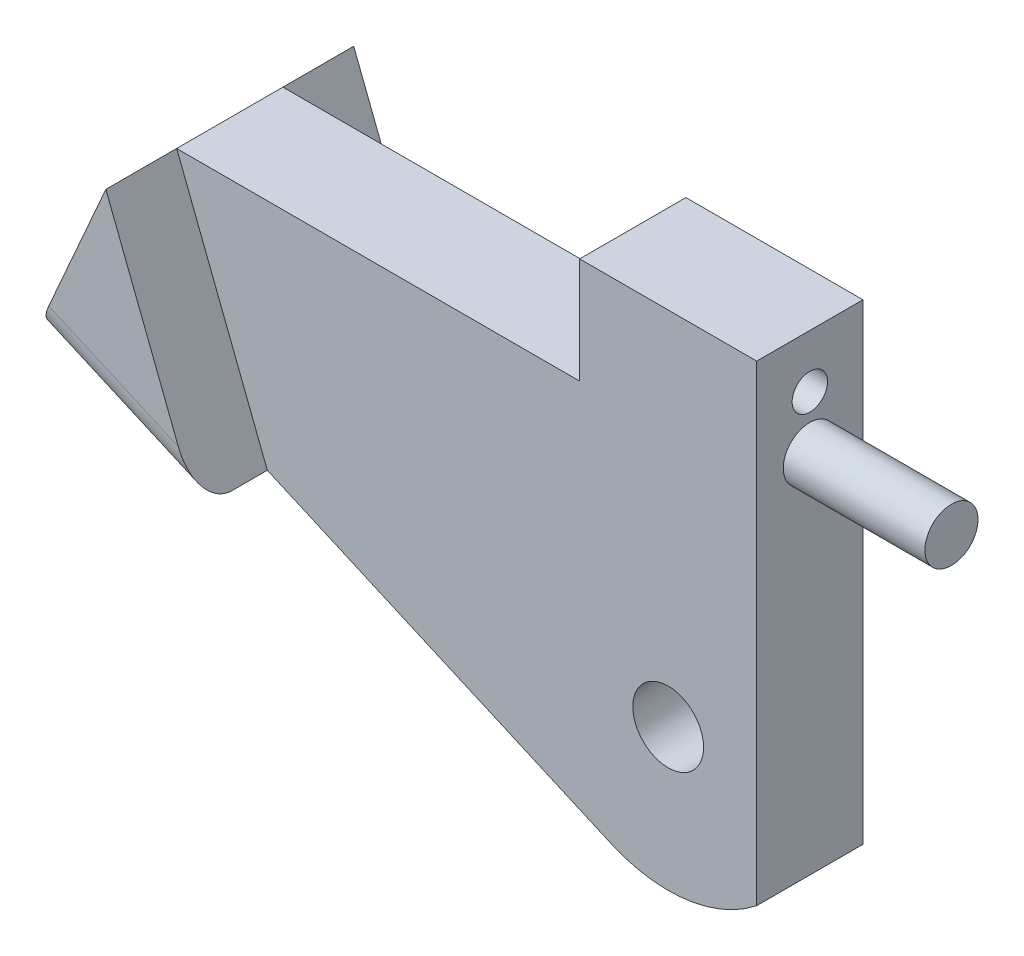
ISO-10303-21;
HEADER;
FILE_DESCRIPTION(('STEP AP214'),'2;1');
FILE_NAME('part.step','',(''),(''),'','','');
FILE_SCHEMA(('AUTOMOTIVE_DESIGN { 1 0 10303 214 1 1 1 1 }'));
ENDSEC;
DATA;
#1=APPLICATION_CONTEXT('core data for automotive mechanical design processes');
#2=APPLICATION_PROTOCOL_DEFINITION('international standard','automotive_design',2000,#1);
#3=PRODUCT_CONTEXT('',#1,'mechanical');
#4=PRODUCT('Part','Part','',(#3));
#5=PRODUCT_RELATED_PRODUCT_CATEGORY('part','',(#4));
#6=PRODUCT_DEFINITION_FORMATION('','',#4);
#7=PRODUCT_DEFINITION_CONTEXT('part definition',#1,'design');
#8=PRODUCT_DEFINITION('design','',#6,#7);
#9=PRODUCT_DEFINITION_SHAPE('','',#8);
#10=(LENGTH_UNIT() NAMED_UNIT(*) SI_UNIT(.MILLI.,.METRE.));
#11=(NAMED_UNIT(*) PLANE_ANGLE_UNIT() SI_UNIT($,.RADIAN.));
#12=(NAMED_UNIT(*) SI_UNIT($,.STERADIAN.) SOLID_ANGLE_UNIT());
#13=UNCERTAINTY_MEASURE_WITH_UNIT(LENGTH_MEASURE(1.E-05),#10,'distance_accuracy_value','');
#14=(GEOMETRIC_REPRESENTATION_CONTEXT(3) GLOBAL_UNCERTAINTY_ASSIGNED_CONTEXT((#13)) GLOBAL_UNIT_ASSIGNED_CONTEXT((#10,
#11,#12)) REPRESENTATION_CONTEXT('',''));
#15=CARTESIAN_POINT('',(0.,0.,0.));
#16=DIRECTION('',(0.,0.,1.));
#17=DIRECTION('',(1.,0.,0.));
#18=AXIS2_PLACEMENT_3D('',#15,#16,#17);
#19=CARTESIAN_POINT('',(2.5,-3.1224989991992,1.5));
#20=DIRECTION('',(-1.,0.,0.));
#21=DIRECTION('',(0.,-1.,0.));
#22=AXIS2_PLACEMENT_3D('',#19,#20,#21);
#23=PLANE('',#22);
#24=DIRECTION('',(0.,1.,0.));
#25=VECTOR('',#24,1.);
#26=CARTESIAN_POINT('',(2.5,-3.1224989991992,-1.5));
#27=LINE('',#26,#25);
#28=CARTESIAN_POINT('',(2.5,-3.1224989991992,-1.5));
#29=VERTEX_POINT('',#28);
#30=CARTESIAN_POINT('',(2.5,10.1980390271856,-1.5));
#31=VERTEX_POINT('',#30);
#32=EDGE_CURVE('E165',#29,#31,#27,.T.);
#33=ORIENTED_EDGE('',*,*,#32,.T.);
#34=DIRECTION('',(0.,0.,-1.));
#35=VECTOR('',#34,1.);
#36=CARTESIAN_POINT('',(2.5,10.1980390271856,1.5));
#37=LINE('',#36,#35);
#38=CARTESIAN_POINT('',(2.5,10.1980390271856,1.5));
#39=VERTEX_POINT('',#38);
#40=EDGE_CURVE('E185',#39,#31,#37,.T.);
#41=ORIENTED_EDGE('',*,*,#40,.F.);
#42=DIRECTION('',(0.,1.,0.));
#43=VECTOR('',#42,1.);
#44=CARTESIAN_POINT('',(2.5,-3.1224989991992,1.5));
#45=LINE('',#44,#43);
#46=CARTESIAN_POINT('',(2.5,-3.1224989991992,1.5));
#47=VERTEX_POINT('',#46);
#48=EDGE_CURVE('E178',#47,#39,#45,.T.);
#49=ORIENTED_EDGE('',*,*,#48,.F.);
#50=DIRECTION('',(0.,0.,-1.));
#51=VECTOR('',#50,1.);
#52=CARTESIAN_POINT('',(2.5,-3.1224989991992,1.5));
#53=LINE('',#52,#51);
#54=EDGE_CURVE('E188',#47,#29,#53,.T.);
#55=ORIENTED_EDGE('',*,*,#54,.T.);
#56=EDGE_LOOP('',(#33,#41,#49,#55));
#57=FACE_BOUND('',#56,.T.);
#58=CARTESIAN_POINT('',(2.5,8.69803902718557,0.));
#59=DIRECTION('',(1.,0.,0.));
#60=DIRECTION('',(0.,1.,0.));
#61=AXIS2_PLACEMENT_3D('',#58,#59,#60);
#62=CIRCLE('',#61,0.500000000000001);
#63=CARTESIAN_POINT('',(2.5,9.19803902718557,0.));
#64=VERTEX_POINT('',#63);
#65=EDGE_CURVE('E431',#64,#64,#62,.T.);
#66=ORIENTED_EDGE('',*,*,#65,.F.);
#67=EDGE_LOOP('',(#66));
#68=FACE_BOUND('',#67,.T.);
#69=CARTESIAN_POINT('',(2.5,7.19803902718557,0.));
#70=DIRECTION('',(-1.,0.,0.));
#71=DIRECTION('',(0.,-1.,0.));
#72=AXIS2_PLACEMENT_3D('',#69,#70,#71);
#73=CIRCLE('',#72,0.75);
#74=CARTESIAN_POINT('',(2.5,6.44803902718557,0.));
#75=VERTEX_POINT('',#74);
#76=EDGE_CURVE('E203',#75,#75,#73,.F.);
#77=ORIENTED_EDGE('',*,*,#76,.F.);
#78=EDGE_LOOP('',(#77));
#79=FACE_BOUND('',#78,.T.);
#80=ADVANCED_FACE('F28',(#57,#68,#79),#23,.F.);
#81=CARTESIAN_POINT('',(0.,0.,1.5));
#82=DIRECTION('',(0.,0.,1.));
#83=DIRECTION('',(1.,0.,0.));
#84=AXIS2_PLACEMENT_3D('',#81,#82,#83);
#85=PLANE('',#84);
#86=CARTESIAN_POINT('',(0.,0.,1.5));
#87=DIRECTION('',(0.,0.,1.));
#88=DIRECTION('',(1.,0.,0.));
#89=AXIS2_PLACEMENT_3D('',#86,#87,#88);
#90=CIRCLE('',#89,1.);
#91=CARTESIAN_POINT('',(1.,0.,1.5));
#92=VERTEX_POINT('',#91);
#93=EDGE_CURVE('E129',#92,#92,#90,.T.);
#94=ORIENTED_EDGE('',*,*,#93,.F.);
#95=EDGE_LOOP('',(#94));
#96=FACE_BOUND('',#95,.T.);
#97=DIRECTION('',(-1.,0.,0.));
#98=VECTOR('',#97,1.);
#99=CARTESIAN_POINT('',(-2.5,7.20803853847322,1.5));
#100=LINE('',#99,#98);
#101=CARTESIAN_POINT('',(-2.5,7.20803853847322,1.5));
#102=VERTEX_POINT('',#101);
#103=CARTESIAN_POINT('',(-13.8822289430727,7.20803853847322,1.5));
#104=VERTEX_POINT('',#103);
#105=EDGE_CURVE('E172',#102,#104,#100,.T.);
#106=ORIENTED_EDGE('',*,*,#105,.T.);
#107=DIRECTION('',(0.362045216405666,-0.932160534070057,0.));
#108=VECTOR('',#107,1.);
#109=CARTESIAN_POINT('',(-9.62999207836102,-3.74022760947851,1.5));
#110=LINE('',#109,#108);
#111=CARTESIAN_POINT('',(-11.3221826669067,0.616668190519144,1.5));
#112=VERTEX_POINT('',#111);
#113=EDGE_CURVE('E152',#104,#112,#110,.T.);
#114=ORIENTED_EDGE('',*,*,#113,.T.);
#115=DIRECTION('',(0.915141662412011,-0.403132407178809,0.));
#116=VECTOR('',#115,1.);
#117=CARTESIAN_POINT('',(-15.8978909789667,2.63233022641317,1.5));
#118=LINE('',#117,#116);
#119=CARTESIAN_POINT('',(-1.61252962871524,-3.66056664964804,1.5));
#120=VERTEX_POINT('',#119);
#121=EDGE_CURVE('E174',#112,#120,#118,.T.);
#122=ORIENTED_EDGE('',*,*,#121,.T.);
#123=CARTESIAN_POINT('',(0.,0.,1.5));
#124=DIRECTION('',(0.,0.,1.));
#125=DIRECTION('',(1.,0.,0.));
#126=AXIS2_PLACEMENT_3D('',#123,#124,#125);
#127=CIRCLE('',#126,4.);
#128=EDGE_CURVE('E176',#120,#47,#127,.T.);
#129=ORIENTED_EDGE('',*,*,#128,.T.);
#130=ORIENTED_EDGE('',*,*,#48,.T.);
#131=DIRECTION('',(-1.,0.,0.));
#132=VECTOR('',#131,1.);
#133=CARTESIAN_POINT('',(-2.5,10.1980390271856,1.5));
#134=LINE('',#133,#132);
#135=CARTESIAN_POINT('',(-2.5,10.1980390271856,1.5));
#136=VERTEX_POINT('',#135);
#137=EDGE_CURVE('E180',#39,#136,#134,.T.);
#138=ORIENTED_EDGE('',*,*,#137,.T.);
#139=DIRECTION('',(0.,-1.,0.));
#140=VECTOR('',#139,1.);
#141=CARTESIAN_POINT('',(-2.5,10.1980390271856,1.5));
#142=LINE('',#141,#140);
#143=EDGE_CURVE('E169',#136,#102,#142,.T.);
#144=ORIENTED_EDGE('',*,*,#143,.T.);
#145=EDGE_LOOP('',(#106,#114,#122,#129,#130,#138,#144));
#146=FACE_BOUND('',#145,.T.);
#147=ADVANCED_FACE('F229',(#96,#146),#85,.T.);
#148=CARTESIAN_POINT('',(0.,0.,-1.5));
#149=DIRECTION('',(0.,0.,1.));
#150=DIRECTION('',(1.,0.,0.));
#151=AXIS2_PLACEMENT_3D('',#148,#149,#150);
#152=PLANE('',#151);
#153=CARTESIAN_POINT('',(0.,0.,-1.5));
#154=DIRECTION('',(0.,0.,1.));
#155=DIRECTION('',(1.,0.,0.));
#156=AXIS2_PLACEMENT_3D('',#153,#154,#155);
#157=CIRCLE('',#156,1.);
#158=CARTESIAN_POINT('',(1.,0.,-1.5));
#159=VERTEX_POINT('',#158);
#160=EDGE_CURVE('E204',#159,#159,#157,.T.);
#161=ORIENTED_EDGE('',*,*,#160,.T.);
#162=EDGE_LOOP('',(#161));
#163=FACE_BOUND('',#162,.T.);
#164=DIRECTION('',(0.362045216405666,-0.932160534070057,0.));
#165=VECTOR('',#164,1.);
#166=CARTESIAN_POINT('',(-9.62999207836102,-3.74022760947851,-1.5));
#167=LINE('',#166,#165);
#168=CARTESIAN_POINT('',(-13.8822289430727,7.20803853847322,-1.5));
#169=VERTEX_POINT('',#168);
#170=CARTESIAN_POINT('',(-11.3221826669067,0.616668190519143,-1.5));
#171=VERTEX_POINT('',#170);
#172=EDGE_CURVE('E201',#169,#171,#167,.T.);
#173=ORIENTED_EDGE('',*,*,#172,.F.);
#174=DIRECTION('',(-1.,0.,0.));
#175=VECTOR('',#174,1.);
#176=CARTESIAN_POINT('',(-2.5,7.20803853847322,-1.5));
#177=LINE('',#176,#175);
#178=CARTESIAN_POINT('',(-2.5,7.20803853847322,-1.5));
#179=VERTEX_POINT('',#178);
#180=EDGE_CURVE('E158',#179,#169,#177,.T.);
#181=ORIENTED_EDGE('',*,*,#180,.F.);
#182=DIRECTION('',(0.,-1.,0.));
#183=VECTOR('',#182,1.);
#184=CARTESIAN_POINT('',(-2.5,10.1980390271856,-1.5));
#185=LINE('',#184,#183);
#186=CARTESIAN_POINT('',(-2.5,10.1980390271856,-1.5));
#187=VERTEX_POINT('',#186);
#188=EDGE_CURVE('E155',#187,#179,#185,.T.);
#189=ORIENTED_EDGE('',*,*,#188,.F.);
#190=DIRECTION('',(-1.,0.,0.));
#191=VECTOR('',#190,1.);
#192=CARTESIAN_POINT('',(-2.5,10.1980390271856,-1.5));
#193=LINE('',#192,#191);
#194=EDGE_CURVE('E167',#31,#187,#193,.T.);
#195=ORIENTED_EDGE('',*,*,#194,.F.);
#196=ORIENTED_EDGE('',*,*,#32,.F.);
#197=CARTESIAN_POINT('',(0.,0.,-1.5));
#198=DIRECTION('',(0.,0.,1.));
#199=DIRECTION('',(1.,0.,0.));
#200=AXIS2_PLACEMENT_3D('',#197,#198,#199);
#201=CIRCLE('',#200,4.);
#202=CARTESIAN_POINT('',(-1.61252962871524,-3.66056664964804,-1.5));
#203=VERTEX_POINT('',#202);
#204=EDGE_CURVE('E163',#203,#29,#201,.T.);
#205=ORIENTED_EDGE('',*,*,#204,.F.);
#206=DIRECTION('',(0.915141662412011,-0.403132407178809,0.));
#207=VECTOR('',#206,1.);
#208=CARTESIAN_POINT('',(-15.8978909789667,2.63233022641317,-1.5));
#209=LINE('',#208,#207);
#210=EDGE_CURVE('E161',#171,#203,#209,.T.);
#211=ORIENTED_EDGE('',*,*,#210,.F.);
#212=EDGE_LOOP('',(#173,#181,#189,#195,#196,#205,#211));
#213=FACE_BOUND('',#212,.T.);
#214=ADVANCED_FACE('F237',(#163,#213),#152,.F.);
#215=CARTESIAN_POINT('',(-2.5,10.1980390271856,1.5));
#216=DIRECTION('',(1.,0.,0.));
#217=DIRECTION('',(0.,1.,0.));
#218=AXIS2_PLACEMENT_3D('',#215,#216,#217);
#219=PLANE('',#218);
#220=CARTESIAN_POINT('',(-2.5,8.69803902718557,0.));
#221=DIRECTION('',(1.,0.,0.));
#222=DIRECTION('',(0.,1.,0.));
#223=AXIS2_PLACEMENT_3D('',#220,#221,#222);
#224=CIRCLE('',#223,0.500000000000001);
#225=CARTESIAN_POINT('',(-2.5,9.19803902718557,0.));
#226=VERTEX_POINT('',#225);
#227=EDGE_CURVE('E207',#226,#226,#224,.T.);
#228=ORIENTED_EDGE('',*,*,#227,.T.);
#229=EDGE_LOOP('',(#228));
#230=FACE_BOUND('',#229,.T.);
#231=ORIENTED_EDGE('',*,*,#188,.T.);
#232=DIRECTION('',(0.,0.,-1.));
#233=VECTOR('',#232,1.);
#234=CARTESIAN_POINT('',(-2.5,7.20803853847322,1.5));
#235=LINE('',#234,#233);
#236=EDGE_CURVE('E198',#102,#179,#235,.T.);
#237=ORIENTED_EDGE('',*,*,#236,.F.);
#238=ORIENTED_EDGE('',*,*,#143,.F.);
#239=DIRECTION('',(0.,0.,-1.));
#240=VECTOR('',#239,1.);
#241=CARTESIAN_POINT('',(-2.5,10.1980390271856,1.5));
#242=LINE('',#241,#240);
#243=EDGE_CURVE('E182',#136,#187,#242,.T.);
#244=ORIENTED_EDGE('',*,*,#243,.T.);
#245=EDGE_LOOP('',(#231,#237,#238,#244));
#246=FACE_BOUND('',#245,.T.);
#247=ADVANCED_FACE('F30',(#230,#246),#219,.F.);
#248=CARTESIAN_POINT('',(-2.5,7.20803853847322,1.5));
#249=DIRECTION('',(0.,-1.,0.));
#250=DIRECTION('',(1.,0.,0.));
#251=AXIS2_PLACEMENT_3D('',#248,#249,#250);
#252=PLANE('',#251);
#253=ORIENTED_EDGE('',*,*,#180,.T.);
#254=DIRECTION('',(0.,0.,-1.));
#255=VECTOR('',#254,1.);
#256=CARTESIAN_POINT('',(-13.8822289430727,7.20803853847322,1.5));
#257=LINE('',#256,#255);
#258=EDGE_CURVE('E137',#104,#169,#257,.T.);
#259=ORIENTED_EDGE('',*,*,#258,.F.);
#260=ORIENTED_EDGE('',*,*,#105,.F.);
#261=ORIENTED_EDGE('',*,*,#236,.T.);
#262=EDGE_LOOP('',(#253,#259,#260,#261));
#263=FACE_BOUND('',#262,.T.);
#264=ADVANCED_FACE('F234',(#263),#252,.F.);
#265=CARTESIAN_POINT('',(-13.8822289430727,7.20803853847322,1.5));
#266=DIRECTION('',(0.915141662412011,-0.403132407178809,0.));
#267=DIRECTION('',(0.403132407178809,0.915141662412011,0.));
#268=AXIS2_PLACEMENT_3D('',#265,#266,#267);
#269=PLANE('',#268);
#270=DIRECTION('',(-0.403132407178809,-0.915141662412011,0.));
#271=VECTOR('',#270,1.);
#272=CARTESIAN_POINT('',(-13.8822289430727,7.20803853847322,-3.5));
#273=LINE('',#272,#271);
#274=CARTESIAN_POINT('',(-13.8822289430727,7.20803853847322,-3.5));
#275=VERTEX_POINT('',#274);
#276=CARTESIAN_POINT('',(-15.4947585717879,3.54747188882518,-3.5));
#277=VERTEX_POINT('',#276);
#278=EDGE_CURVE('E128',#275,#277,#273,.T.);
#279=ORIENTED_EDGE('',*,*,#278,.T.);
#280=CARTESIAN_POINT('',(-15.4947585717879,3.54747188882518,-2.5));
#281=DIRECTION('',(0.915141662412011,-0.403132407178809,0.));
#282=DIRECTION('',(0.403132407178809,0.915141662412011,0.));
#283=AXIS2_PLACEMENT_3D('',#280,#281,#282);
#284=CIRCLE('',#283,1.);
#285=CARTESIAN_POINT('',(-15.8978909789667,2.63233022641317,-2.5));
#286=VERTEX_POINT('',#285);
#287=EDGE_CURVE('E218',#277,#286,#284,.F.);
#288=ORIENTED_EDGE('',*,*,#287,.T.);
#289=DIRECTION('',(0.,0.,-1.));
#290=VECTOR('',#289,1.);
#291=CARTESIAN_POINT('',(-15.8978909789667,2.63233022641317,1.5));
#292=LINE('',#291,#290);
#293=CARTESIAN_POINT('',(-15.8978909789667,2.63233022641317,2.5));
#294=VERTEX_POINT('',#293);
#295=EDGE_CURVE('E194',#294,#286,#292,.T.);
#296=ORIENTED_EDGE('',*,*,#295,.F.);
#297=CARTESIAN_POINT('',(-15.4947585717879,3.54747188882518,2.5));
#298=DIRECTION('',(0.915141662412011,-0.403132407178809,0.));
#299=DIRECTION('',(0.403132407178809,0.915141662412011,0.));
#300=AXIS2_PLACEMENT_3D('',#297,#298,#299);
#301=CIRCLE('',#300,1.);
#302=CARTESIAN_POINT('',(-15.4947585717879,3.54747188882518,3.5));
#303=VERTEX_POINT('',#302);
#304=EDGE_CURVE('E49',#294,#303,#301,.F.);
#305=ORIENTED_EDGE('',*,*,#304,.T.);
#306=DIRECTION('',(-0.403132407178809,-0.915141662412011,0.));
#307=VECTOR('',#306,1.);
#308=CARTESIAN_POINT('',(-13.8822289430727,7.20803853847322,3.5));
#309=LINE('',#308,#307);
#310=CARTESIAN_POINT('',(-13.8822289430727,7.20803853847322,3.5));
#311=VERTEX_POINT('',#310);
#312=EDGE_CURVE('E145',#311,#303,#309,.T.);
#313=ORIENTED_EDGE('',*,*,#312,.F.);
#314=DIRECTION('',(0.,0.,-1.));
#315=VECTOR('',#314,1.);
#316=CARTESIAN_POINT('',(-13.8822289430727,7.20803853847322,3.5));
#317=LINE('',#316,#315);
#318=EDGE_CURVE('E138',#311,#104,#317,.T.);
#319=ORIENTED_EDGE('',*,*,#318,.T.);
#320=ORIENTED_EDGE('',*,*,#258,.T.);
#321=EDGE_CURVE('E122',#169,#275,#317,.T.);
#322=ORIENTED_EDGE('',*,*,#321,.T.);
#323=EDGE_LOOP('',(#279,#288,#296,#305,#313,#319,#320,#322));
#324=FACE_BOUND('',#323,.T.);
#325=ADVANCED_FACE('F133',(#324),#269,.F.);
#326=CARTESIAN_POINT('',(-15.8978909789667,2.63233022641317,1.5));
#327=DIRECTION('',(0.403132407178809,0.915141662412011,0.));
#328=DIRECTION('',(-0.915141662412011,0.403132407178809,0.));
#329=AXIS2_PLACEMENT_3D('',#326,#327,#328);
#330=PLANE('',#329);
#331=ORIENTED_EDGE('',*,*,#295,.T.);
#332=DIRECTION('',(0.915141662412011,-0.403132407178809,0.));
#333=VECTOR('',#332,1.);
#334=CARTESIAN_POINT('',(-11.3221826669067,0.616668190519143,-2.5));
#335=LINE('',#334,#333);
#336=CARTESIAN_POINT('',(-11.3221826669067,0.616668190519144,-2.5));
#337=VERTEX_POINT('',#336);
#338=EDGE_CURVE('E212',#286,#337,#335,.T.);
#339=ORIENTED_EDGE('',*,*,#338,.T.);
#340=DIRECTION('',(0.,0.,-1.));
#341=VECTOR('',#340,1.);
#342=CARTESIAN_POINT('',(-11.3221826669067,0.616668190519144,3.5));
#343=LINE('',#342,#341);
#344=EDGE_CURVE('E150',#171,#337,#343,.T.);
#345=ORIENTED_EDGE('',*,*,#344,.F.);
#346=ORIENTED_EDGE('',*,*,#210,.T.);
#347=DIRECTION('',(0.,0.,-1.));
#348=VECTOR('',#347,1.);
#349=CARTESIAN_POINT('',(-1.61252962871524,-3.66056664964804,1.5));
#350=LINE('',#349,#348);
#351=EDGE_CURVE('E191',#120,#203,#350,.T.);
#352=ORIENTED_EDGE('',*,*,#351,.F.);
#353=ORIENTED_EDGE('',*,*,#121,.F.);
#354=CARTESIAN_POINT('',(-11.3221826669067,0.616668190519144,2.5));
#355=VERTEX_POINT('',#354);
#356=EDGE_CURVE('E139',#355,#112,#343,.T.);
#357=ORIENTED_EDGE('',*,*,#356,.F.);
#358=DIRECTION('',(0.915141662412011,-0.403132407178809,0.));
#359=VECTOR('',#358,1.);
#360=CARTESIAN_POINT('',(-15.8978909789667,2.63233022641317,2.5));
#361=LINE('',#360,#359);
#362=EDGE_CURVE('E210',#355,#294,#361,.F.);
#363=ORIENTED_EDGE('',*,*,#362,.T.);
#364=EDGE_LOOP('',(#331,#339,#345,#346,#352,#353,#357,#363));
#365=FACE_BOUND('',#364,.T.);
#366=ADVANCED_FACE('F242',(#365),#330,.F.);
#367=CARTESIAN_POINT('',(0.,0.,1.5));
#368=DIRECTION('',(0.,0.,-1.));
#369=DIRECTION('',(-1.,0.,0.));
#370=AXIS2_PLACEMENT_3D('',#367,#368,#369);
#371=CYLINDRICAL_SURFACE('',#370,4.);
#372=ORIENTED_EDGE('',*,*,#204,.T.);
#373=ORIENTED_EDGE('',*,*,#54,.F.);
#374=ORIENTED_EDGE('',*,*,#128,.F.);
#375=ORIENTED_EDGE('',*,*,#351,.T.);
#376=EDGE_LOOP('',(#372,#373,#374,#375));
#377=FACE_BOUND('',#376,.T.);
#378=ADVANCED_FACE('F250',(#377),#371,.T.);
#379=CARTESIAN_POINT('',(-2.5,10.1980390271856,1.5));
#380=DIRECTION('',(0.,-1.,0.));
#381=DIRECTION('',(0.,0.,-1.));
#382=AXIS2_PLACEMENT_3D('',#379,#380,#381);
#383=PLANE('',#382);
#384=ORIENTED_EDGE('',*,*,#194,.T.);
#385=ORIENTED_EDGE('',*,*,#243,.F.);
#386=ORIENTED_EDGE('',*,*,#137,.F.);
#387=ORIENTED_EDGE('',*,*,#40,.T.);
#388=EDGE_LOOP('',(#384,#385,#386,#387));
#389=FACE_BOUND('',#388,.T.);
#390=ADVANCED_FACE('F259',(#389),#383,.F.);
#391=CARTESIAN_POINT('',(-11.3221826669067,0.616668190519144,-3.5));
#392=DIRECTION('',(0.,0.,-1.));
#393=DIRECTION('',(-1.,0.,0.));
#394=AXIS2_PLACEMENT_3D('',#391,#392,#393);
#395=PLANE('',#394);
#396=DIRECTION('',(-0.362045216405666,0.932160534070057,0.));
#397=VECTOR('',#396,1.);
#398=CARTESIAN_POINT('',(-11.3221826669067,0.616668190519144,-3.5));
#399=LINE('',#398,#397);
#400=CARTESIAN_POINT('',(-11.8341919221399,1.93494226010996,-3.5));
#401=VERTEX_POINT('',#400);
#402=EDGE_CURVE('E117',#401,#275,#399,.T.);
#403=ORIENTED_EDGE('',*,*,#402,.F.);
#404=DIRECTION('',(0.915141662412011,-0.403132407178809,0.));
#405=VECTOR('',#404,1.);
#406=CARTESIAN_POINT('',(-15.4947585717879,3.54747188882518,-3.5));
#407=LINE('',#406,#405);
#408=EDGE_CURVE('E142',#401,#277,#407,.F.);
#409=ORIENTED_EDGE('',*,*,#408,.T.);
#410=ORIENTED_EDGE('',*,*,#278,.F.);
#411=EDGE_LOOP('',(#403,#409,#410));
#412=FACE_BOUND('',#411,.T.);
#413=ADVANCED_FACE('F141',(#412),#395,.T.);
#414=CARTESIAN_POINT('',(-11.3221826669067,0.616668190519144,3.5));
#415=DIRECTION('',(-0.932160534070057,-0.362045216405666,0.));
#416=DIRECTION('',(0.362045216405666,-0.932160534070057,0.));
#417=AXIS2_PLACEMENT_3D('',#414,#415,#416);
#418=PLANE('',#417);
#419=ORIENTED_EDGE('',*,*,#344,.T.);
#420=CARTESIAN_POINT('',(-11.8341919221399,1.93494226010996,-2.5));
#421=DIRECTION('',(-0.932160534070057,-0.362045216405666,0.));
#422=DIRECTION('',(-0.362045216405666,0.932160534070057,0.));
#423=AXIS2_PLACEMENT_3D('',#420,#421,#422);
#424=ELLIPSE('',#423,1.41421356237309,1.);
#425=EDGE_CURVE('E124',#337,#401,#424,.F.);
#426=ORIENTED_EDGE('',*,*,#425,.T.);
#427=ORIENTED_EDGE('',*,*,#402,.T.);
#428=ORIENTED_EDGE('',*,*,#321,.F.);
#429=ORIENTED_EDGE('',*,*,#172,.T.);
#430=EDGE_LOOP('',(#419,#426,#427,#428,#429));
#431=FACE_BOUND('',#430,.T.);
#432=ADVANCED_FACE('F120',(#431),#418,.F.);
#433=DIRECTION('',(-0.362045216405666,0.932160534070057,0.));
#434=VECTOR('',#433,1.);
#435=CARTESIAN_POINT('',(-11.3221826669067,0.616668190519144,3.5));
#436=LINE('',#435,#434);
#437=CARTESIAN_POINT('',(-11.8341919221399,1.93494226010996,3.5));
#438=VERTEX_POINT('',#437);
#439=EDGE_CURVE('E143',#438,#311,#436,.T.);
#440=ORIENTED_EDGE('',*,*,#439,.F.);
#441=CARTESIAN_POINT('',(-11.8341919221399,1.93494226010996,2.5));
#442=DIRECTION('',(-0.932160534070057,-0.362045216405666,0.));
#443=DIRECTION('',(0.362045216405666,-0.932160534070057,0.));
#444=AXIS2_PLACEMENT_3D('',#441,#442,#443);
#445=ELLIPSE('',#444,1.41421356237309,1.);
#446=EDGE_CURVE('E11',#438,#355,#445,.F.);
#447=ORIENTED_EDGE('',*,*,#446,.T.);
#448=ORIENTED_EDGE('',*,*,#356,.T.);
#449=ORIENTED_EDGE('',*,*,#113,.F.);
#450=ORIENTED_EDGE('',*,*,#318,.F.);
#451=EDGE_LOOP('',(#440,#447,#448,#449,#450));
#452=FACE_BOUND('',#451,.T.);
#453=ADVANCED_FACE('F224',(#452),#418,.F.);
#454=CARTESIAN_POINT('',(-11.3221826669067,0.616668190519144,3.5));
#455=DIRECTION('',(0.,0.,-1.));
#456=DIRECTION('',(-1.,0.,0.));
#457=AXIS2_PLACEMENT_3D('',#454,#455,#456);
#458=PLANE('',#457);
#459=ORIENTED_EDGE('',*,*,#312,.T.);
#460=DIRECTION('',(0.915141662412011,-0.403132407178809,0.));
#461=VECTOR('',#460,1.);
#462=CARTESIAN_POINT('',(-10.9190502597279,1.53180985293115,3.5));
#463=LINE('',#462,#461);
#464=EDGE_CURVE('E36',#303,#438,#463,.T.);
#465=ORIENTED_EDGE('',*,*,#464,.T.);
#466=ORIENTED_EDGE('',*,*,#439,.T.);
#467=EDGE_LOOP('',(#459,#465,#466));
#468=FACE_BOUND('',#467,.T.);
#469=ADVANCED_FACE('F221',(#468),#458,.F.);
#470=CARTESIAN_POINT('',(0.,0.,-3.5));
#471=DIRECTION('',(0.,0.,1.));
#472=DIRECTION('',(1.,0.,0.));
#473=AXIS2_PLACEMENT_3D('',#470,#471,#472);
#474=CYLINDRICAL_SURFACE('',#473,1.);
#475=ORIENTED_EDGE('',*,*,#93,.T.);
#476=EDGE_LOOP('',(#475));
#477=FACE_BOUND('',#476,.T.);
#478=ORIENTED_EDGE('',*,*,#160,.F.);
#479=EDGE_LOOP('',(#478));
#480=FACE_BOUND('',#479,.T.);
#481=ADVANCED_FACE('F325',(#477,#480),#474,.F.);
#482=CARTESIAN_POINT('',(-15.8978909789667,8.69803902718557,0.));
#483=DIRECTION('',(1.,0.,0.));
#484=DIRECTION('',(0.,1.,0.));
#485=AXIS2_PLACEMENT_3D('',#482,#483,#484);
#486=CYLINDRICAL_SURFACE('',#485,0.500000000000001);
#487=ORIENTED_EDGE('',*,*,#65,.T.);
#488=EDGE_LOOP('',(#487));
#489=FACE_BOUND('',#488,.T.);
#490=ORIENTED_EDGE('',*,*,#227,.F.);
#491=EDGE_LOOP('',(#490));
#492=FACE_BOUND('',#491,.T.);
#493=ADVANCED_FACE('F333',(#489,#492),#486,.F.);
#494=CARTESIAN_POINT('',(6.5,7.19803902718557,0.));
#495=DIRECTION('',(-1.,0.,0.));
#496=DIRECTION('',(0.,-1.,0.));
#497=AXIS2_PLACEMENT_3D('',#494,#495,#496);
#498=CYLINDRICAL_SURFACE('',#497,0.75);
#499=CARTESIAN_POINT('',(6.5,7.19803902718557,0.));
#500=DIRECTION('',(1.,0.,0.));
#501=DIRECTION('',(0.,1.,0.));
#502=AXIS2_PLACEMENT_3D('',#499,#500,#501);
#503=CIRCLE('',#502,0.75);
#504=CARTESIAN_POINT('',(6.5,7.94803902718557,0.));
#505=VERTEX_POINT('',#504);
#506=EDGE_CURVE('E430',#505,#505,#503,.T.);
#507=ORIENTED_EDGE('',*,*,#506,.F.);
#508=EDGE_LOOP('',(#507));
#509=FACE_BOUND('',#508,.T.);
#510=ORIENTED_EDGE('',*,*,#76,.T.);
#511=EDGE_LOOP('',(#510));
#512=FACE_BOUND('',#511,.T.);
#513=ADVANCED_FACE('F342',(#509,#512),#498,.T.);
#514=CARTESIAN_POINT('',(6.5,7.19803902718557,0.));
#515=DIRECTION('',(1.,0.,0.));
#516=DIRECTION('',(0.,1.,0.));
#517=AXIS2_PLACEMENT_3D('',#514,#515,#516);
#518=PLANE('',#517);
#519=ORIENTED_EDGE('',*,*,#506,.T.);
#520=EDGE_LOOP('',(#519));
#521=FACE_BOUND('',#520,.T.);
#522=ADVANCED_FACE('F350',(#521),#518,.T.);
#523=CARTESIAN_POINT('',(-15.4947585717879,3.54747188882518,-2.5));
#524=DIRECTION('',(-0.915141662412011,0.403132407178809,0.));
#525=DIRECTION('',(-0.403132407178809,-0.915141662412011,0.));
#526=AXIS2_PLACEMENT_3D('',#523,#524,#525);
#527=CYLINDRICAL_SURFACE('',#526,1.);
#528=ORIENTED_EDGE('',*,*,#287,.F.);
#529=ORIENTED_EDGE('',*,*,#408,.F.);
#530=ORIENTED_EDGE('',*,*,#425,.F.);
#531=ORIENTED_EDGE('',*,*,#338,.F.);
#532=EDGE_LOOP('',(#528,#529,#530,#531));
#533=FACE_BOUND('',#532,.T.);
#534=ADVANCED_FACE('F245',(#533),#527,.T.);
#535=CARTESIAN_POINT('',(-10.9190502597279,1.53180985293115,2.5));
#536=DIRECTION('',(0.915141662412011,-0.403132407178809,0.));
#537=DIRECTION('',(0.403132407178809,0.915141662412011,0.));
#538=AXIS2_PLACEMENT_3D('',#535,#536,#537);
#539=CYLINDRICAL_SURFACE('',#538,1.);
#540=ORIENTED_EDGE('',*,*,#304,.F.);
#541=ORIENTED_EDGE('',*,*,#362,.F.);
#542=ORIENTED_EDGE('',*,*,#446,.F.);
#543=ORIENTED_EDGE('',*,*,#464,.F.);
#544=EDGE_LOOP('',(#540,#541,#542,#543));
#545=FACE_BOUND('',#544,.T.);
#546=ADVANCED_FACE('F246',(#545),#539,.T.);
#547=CLOSED_SHELL('',(#80,#147,#214,#247,#264,#325,#366,#378,#390,#413,#432,#453,#469,#481,#493,
#513,#522,#534,#546));
#548=MANIFOLD_SOLID_BREP('B2',#547);
#549=ADVANCED_BREP_SHAPE_REPRESENTATION('',(#18,#548),#14);
#550=SHAPE_DEFINITION_REPRESENTATION(#9,#549);
ENDSEC;
END-ISO-10303-21;
